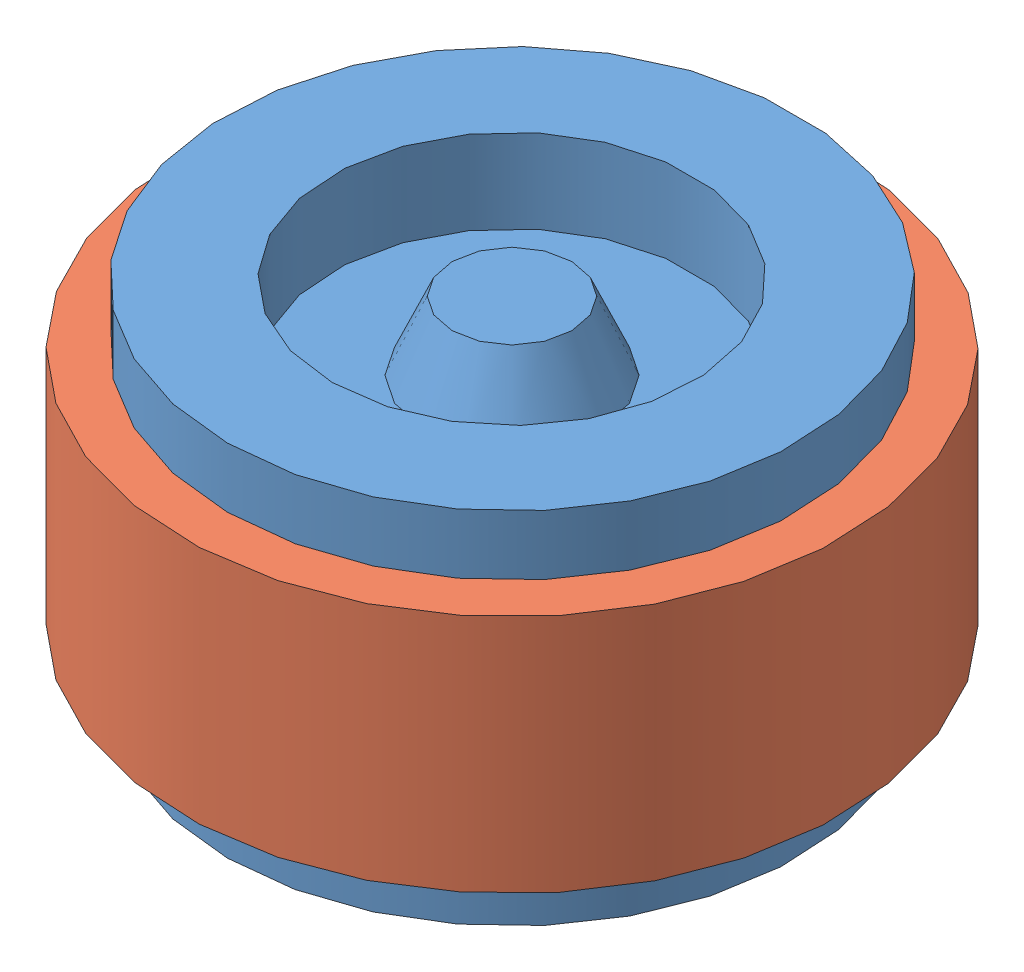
SolidWorks assembly roue.SLDASM, configuration Default (file format 14000). Lengths in mm.
Overall size (30.45 14 30.45).
2 component instances, 2 part files, 2 mates.
Components (placement in the parent):
- jante-1: jante.SLDPRT [Défaut] at origin size (19 14 19)
- pneu-1: pneu.SLDPRT [Défaut] at (0 54 0) x (-0.837169 0 -0.546944) z (-0.546944 0 0.837169) size (22 8 22)
Mates (geometry in assembly coordinates):
- Coïncidente1: coincident anti-aligned: plane of jante-1 through (9.5 4 0) normal (0 1 0); plane of pneu-1 through (-7.1159 4 -4.649) normal (0 -1 0)
- Coaxiale1: concentric anti-aligned: cylinder of jante-1 through (0 20 0) axis (0 1 0) radius 8.6625; cylinder of pneu-1 through (0 -36 0) axis (0 -1 0) radius 8.5
